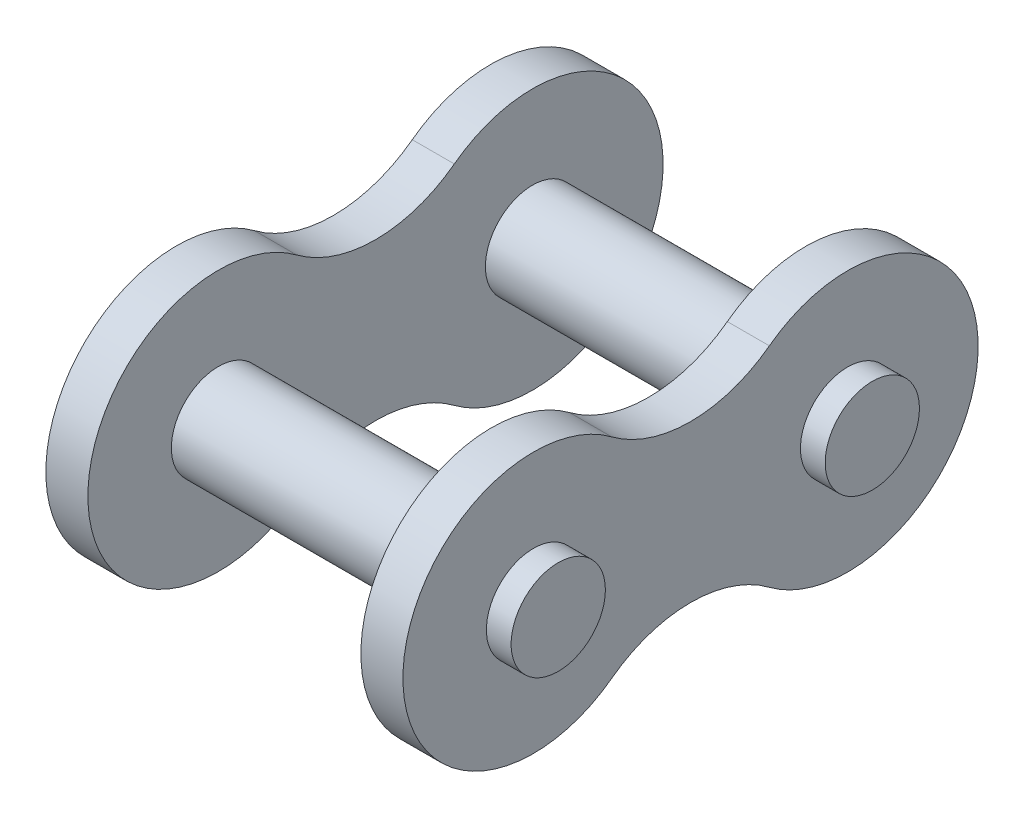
from build123d import *

# Parameters (mm, degrees)
SZKIC1_R                         = 4.765
DODANIE_WYCI_GNI_CIE1_DEPTH      = 4.25
DODANIE_WYCI_GNI_CIE2_DEPTH      = 38.6
DODANIE_WYCI_GNI_CIE2_DEPTH_BACK = 2.5
SZKIC2_R                         = 4.765
DODANIE_WYCI_GNI_CIE3_START      = -4.25
DODANIE_WYCI_GNI_CIE3_DEPTH      = 4.25


with BuildPart() as part:
    # Szkic1 → Dodanie-wyci_gni_cie1 (new body)
    with BuildSketch(Plane(origin=(0, 0, 0), x_dir=(0, 0, -1), z_dir=(1, 0, 0))):
        with BuildLine():
            ThreePointArc((7.906020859, 10.570469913), (-13.2, 0), (7.906020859, -10.570469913))
            ThreePointArc((7.906020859, -10.570469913), (15.875, -7.92), (23.843979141, -10.570469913))
            ThreePointArc((23.843979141, -10.570469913), (44.95, 0), (23.843979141, 10.570469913))
            ThreePointArc((23.843979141, 10.570469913), (15.875, 7.92), (7.906020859, 10.570469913))
        make_face()
        with Locations((31.75, 0)):
            Circle(SZKIC1_R, mode=Mode.SUBTRACT)
        Circle(SZKIC1_R, mode=Mode.SUBTRACT)
    extrude(amount=DODANIE_WYCI_GNI_CIE1_DEPTH)

    # Szkic2 → Dodanie-wyci_gni_cie2 (add, two sides: drawn at the far end of the back side and taken through both)
    with BuildSketch(Plane(origin=(0, 0, 0), x_dir=(0, 0, -1), z_dir=(1, 0, 0)).offset(-DODANIE_WYCI_GNI_CIE2_DEPTH_BACK)):
        Circle(SZKIC2_R)
        with Locations((31.75, 0)):
            Circle(SZKIC2_R)
    extrude(amount=DODANIE_WYCI_GNI_CIE2_DEPTH + DODANIE_WYCI_GNI_CIE2_DEPTH_BACK)

    # Szkic3 → Dodanie-wyci_gni_cie3 (add)
    with BuildSketch(Plane(origin=(36.1, 0, 0), x_dir=(0, 0, -1), z_dir=(1, 0, 0)).offset(DODANIE_WYCI_GNI_CIE3_START)):
        with BuildLine():
            ThreePointArc((23.843979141, -10.570469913), (15.875, -7.92), (7.906020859, -10.570469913))
            ThreePointArc((7.906020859, -10.570469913), (-13.2, 0), (7.906020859, 10.570469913))
            ThreePointArc((7.906020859, 10.570469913), (15.875, 7.92), (23.843979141, 10.570469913))
            ThreePointArc((23.843979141, 10.570469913), (44.95, 0), (23.843979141, -10.570469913))
        make_face()
    extrude(amount=DODANIE_WYCI_GNI_CIE3_DEPTH)


solid = part.part
